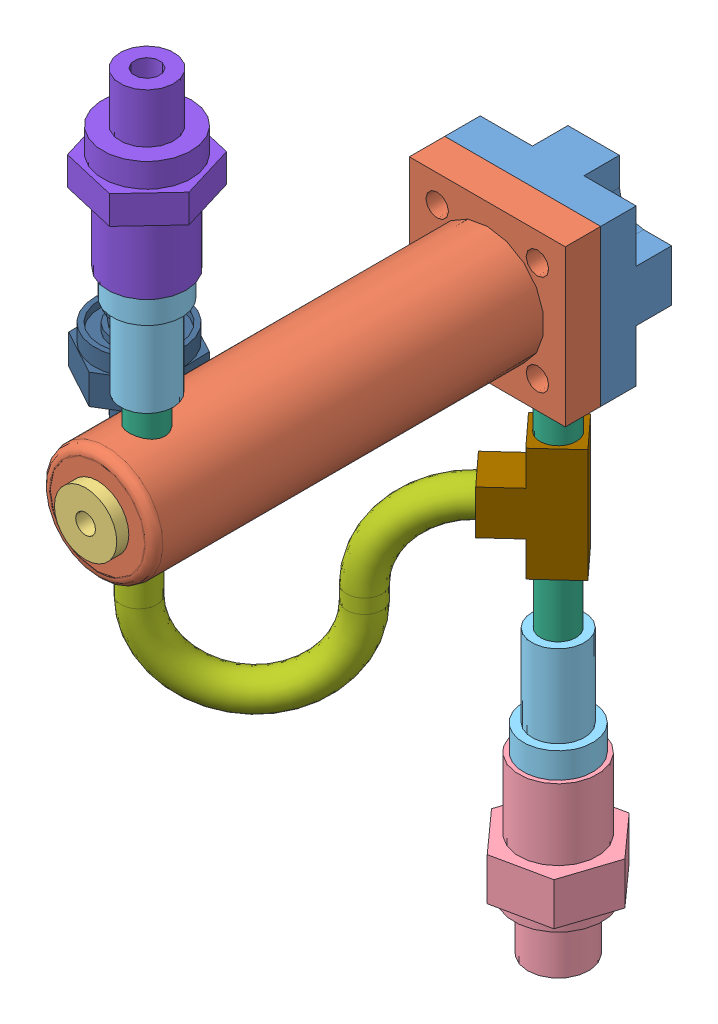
SolidWorks assembly hi_p_filter1.SLDASM, configuration Default (file format 3400). Lengths in mm.
Overall size (65.11 174.18 100.32).
13 component instances, 10 part files, 22 mates.
Components (placement in the parent):
- filter_block-1: filter_block.SLDPRT [Default] at origin size (27.94 27.94 20.83)
- filter_cylinder-1: filter_cylinder.SLDPRT [Default] at (0 0 12.7) x (0 -1 0) z (0 0 1) size (27.94 27.94 76.2)
- boss_plug_5_16-1: boss_plug_5_16.SLDPRT [Default] at (0 0 81.7372) size (11.18 11.18 9.27)
- ss_4_vco_1_4st-1: ss_4_vco_1_4st.SLDPRT [Default] at (0 -108.966 6.35) x (-0.744167 0 0.667994) z (0 1 0) size (17.46 20.16 31.24)
- ss_4_vco_3-1: ss_4_vco_3.SLDPRT [Default] at (0 -77.724 6.35) x (0.939769 0 0.341811) z (0 1 0) size (12.45 12.45 19.3)
- tube_tee-1: tube_tee.SLDPRT [Default] at (0 -30.1753 6.35) x (0.895691 0 0.444676) z (0 1 0) size (6.35 6.35 19.3)
- tube_tee-2: tube_tee.SLDPRT [Default] at (0 -0.1533 80.01) x (0.333725 0 0.94267) z (0 1 0) size (6.35 6.35 19.3)
- Hyd_tube_1-1: Hyd_tube_1.SLDPRT [Default] at (-39.1845 -23.622 42.2588) x (0.737251 0 -0.675619) z (0 1 0) size (48.58 6.35 53.85)
- ss_4_vco_3-2: ss_4_vco_3.SLDPRT [Default] at (0 34.2221 80.01) x (0.843642 0 0.536906) z (0 -1 0) size (12.45 12.45 19.3)
- ss_4_vco_1_4_npt-1: ss_4_vco_1_4_npt.SLDPRT [Default] at (0 65.2101 80.01) x (0.729884 0 0.683571) z (0 -1 0) size (17.46 20.16 30.99)
- GHI-8170 Hi P Filter Weld Tee-1: GHI-8170 Hi P Filter Weld Tee.SLDPRT [Default] at (5.5625 -38.1 6.5926) x (0 -1 0) z (-0.675619 0 -0.737251) size (20.32 14.22 7.87)
- tube_tee-3: tube_tee.SLDPRT [Default] at (0 -63.6408 6.35) x (0.784165 0 -0.620552) z (0 1 0) size (6.35 6.35 19.3)
- GHF-8416-M PUMP OUTPUT CONNECTOR-1: GHF-8416-M PUMP OUTPUT CONNECTOR.SLDPRT [Default] at (-39.1845 -15.748 42.2588) x (0.853567 0 -0.520983) z (-0.520983 0 -0.853567) size (18.33 24.38 15.88)
Mates (geometry in assembly coordinates):
- Concentric1: concentric aligned: cylinder of filter_block-1; cylinder of filter_cylinder-1
- Coincident1: coincident anti-aligned: plane of filter_block-1 through (13.97 -13.97 12.7) normal (0 0 1); plane of filter_cylinder-1 through (-13.97 -13.97 12.7) normal (0 0 -1)
- Concentric3: concentric aligned: cylinder of filter_block-1; cylinder of filter_cylinder-1
- Coincident2: coincident anti-aligned: plane of filter_cylinder-1 through (0 0 88.8492) normal (0 0 1); plane of boss_plug_5_16-1 through (0 0 88.8492) normal (0 0 -1)
- Concentric4: concentric anti-aligned: cylinder of filter_cylinder-1; cylinder of boss_plug_5_16-1
- Concentric5: concentric aligned: cylinder of filter_block-1; cylinder of tube_tee-1
- Concentric6: concentric aligned: cylinder of ss_4_vco_1_4st-1; cylinder of ss_4_vco_3-1
- Coincident3: coincident anti-aligned: plane of ss_4_vco_1_4st-1 through (0 -77.724 6.35) normal (0 1 0); plane of ss_4_vco_3-1 through (0 -77.724 6.35) normal (0 -1 0)
- Concentric7: concentric aligned: cylinder of ss_4_vco_3-1; cylinder of tube_tee-1
- Concentric8: concentric anti-aligned: cylinder of filter_cylinder-1; cylinder of tube_tee-2
- Concentric9: concentric anti-aligned: cylinder of ss_4_vco_3-2; cylinder of tube_tee-2
- Concentric10: concentric aligned: cylinder of ss_4_vco_3-2; cylinder of ss_4_vco_1_4_npt-1
- Coincident4: coincident anti-aligned: plane of ss_4_vco_3-2 through (0 34.2221 80.01) normal (0 1 0); plane of ss_4_vco_1_4_npt-1 through (0 34.2221 80.01) normal (0 -1 0)
- Concentric11: concentric anti-aligned: cylinder of tube_tee-1; cylinder of GHI-8170 Hi P Filter Weld Tee-1
- Concentric12: concentric anti-aligned: cylinder of Hyd_tube_1-1; cylinder of GHI-8170 Hi P Filter Weld Tee-1
- Concentric13: concentric aligned: cylinder of ss_4_vco_3-1; cylinder of tube_tee-3
- Concentric14: concentric aligned: cylinder of Hyd_tube_1-1; cylinder of GHF-8416-M PUMP OUTPUT CONNECTOR-1
- Parallel1: parallel anti-aligned: line of ss_4_vco_1_4_npt-1; line of GHF-8416-M PUMP OUTPUT CONNECTOR-1
- Coincident6: coincident aligned: circle of Hyd_tube_1-1; plane of GHI-8170 Hi P Filter Weld Tee-1 through (-10.244 -34.163 10.3975) normal (-0.737251 0 0.675619)
- Distance1: distance = 13.97 mm anti-aligned: plane of filter_block-1 through (-13.97 -13.97 12.7) normal (0 -1 0); plane of GHI-8170 Hi P Filter Weld Tee-1 through (0.2426 -27.94 0.7875) normal (0 1 0)
- Distance2: distance = 10.16 mm anti-aligned: plane of ss_4_vco_3-1 through (0 -58.42 6.35) normal (0 1 0); plane of GHI-8170 Hi P Filter Weld Tee-1 through (0.2426 -48.26 0.7875) normal (0 -1 0)
- Coincident11: coincident aligned: plane of Hyd_tube_1-1 through (-39.1845 -23.622 42.2588) normal (0 1 0); circle of GHF-8416-M PUMP OUTPUT CONNECTOR-1
